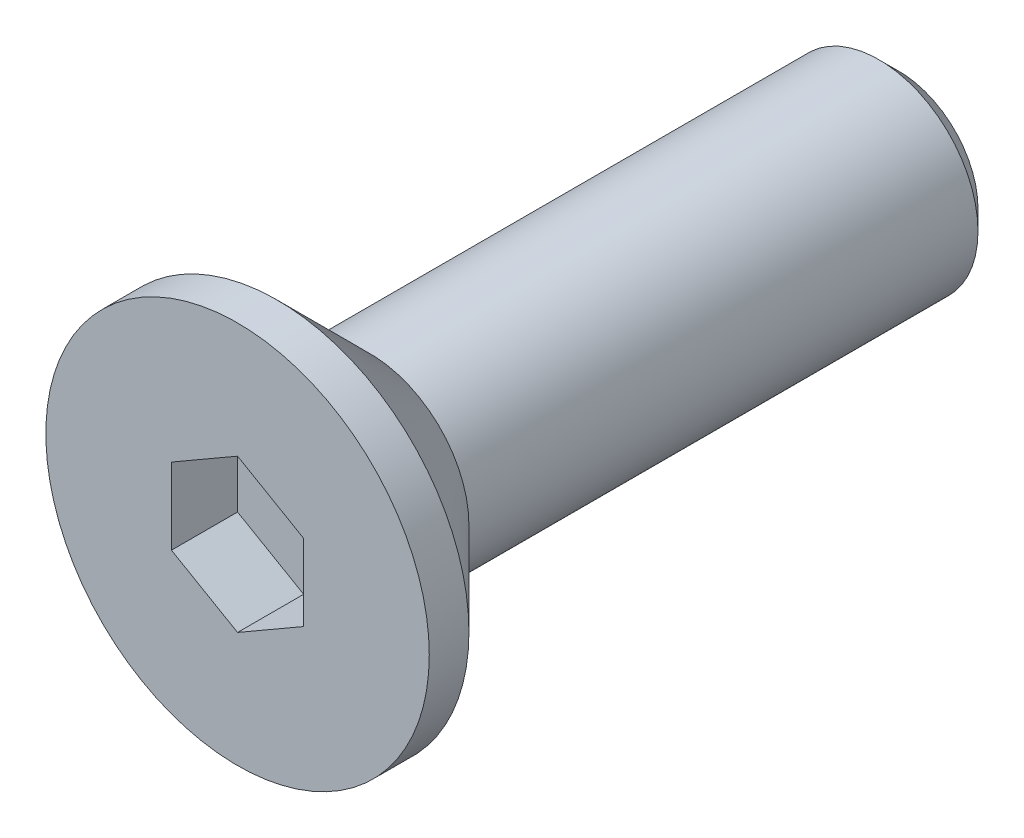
from build123d import *

# Parameters (mm, degrees)
SCHNITT_LINEAR_AUSTRAGEN1_DEPTH = 1
FASE1_SIZE                      = 0.3


with BuildPart() as part:
    # Skizze1 → Rotation1 (revolve)
    with BuildSketch(Plane(origin=(0, 0, 0), x_dir=(0, 0, -1), z_dir=(1, 0, 0)), mode=Mode.PRIVATE) as rotation1_sk:
        Polygon((0, 0), (0, 2.9), (0.6, 2.9), (2, 1.5), (10, 1.5), (10, 0), align=None)
    revolve(rotation1_sk.sketch.rotate(Axis((0, 0, 31.763581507), (0, 0, -1)), 90), axis=Axis((0, 0, 31.763581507), (0, 0, -1)))

    # Skizze3 → Schnitt-Linear austragen1 (cut)
    with BuildSketch(Plane.XY):
        Polygon((1, -0.577350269), (1, 0.577350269), (0, 1.154700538), (-1, 0.577350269), (-1, -0.577350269), (0, -1.154700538), align=None)
    extrude(amount=-SCHNITT_LINEAR_AUSTRAGEN1_DEPTH, mode=Mode.SUBTRACT)

    # Fase1
    fase1_edges = [part.edges().sort_by_distance(p)[0] for p in [
        (-1.5, 0, -10),
    ]]
    chamfer(fase1_edges, length=FASE1_SIZE)


solid = part.part
